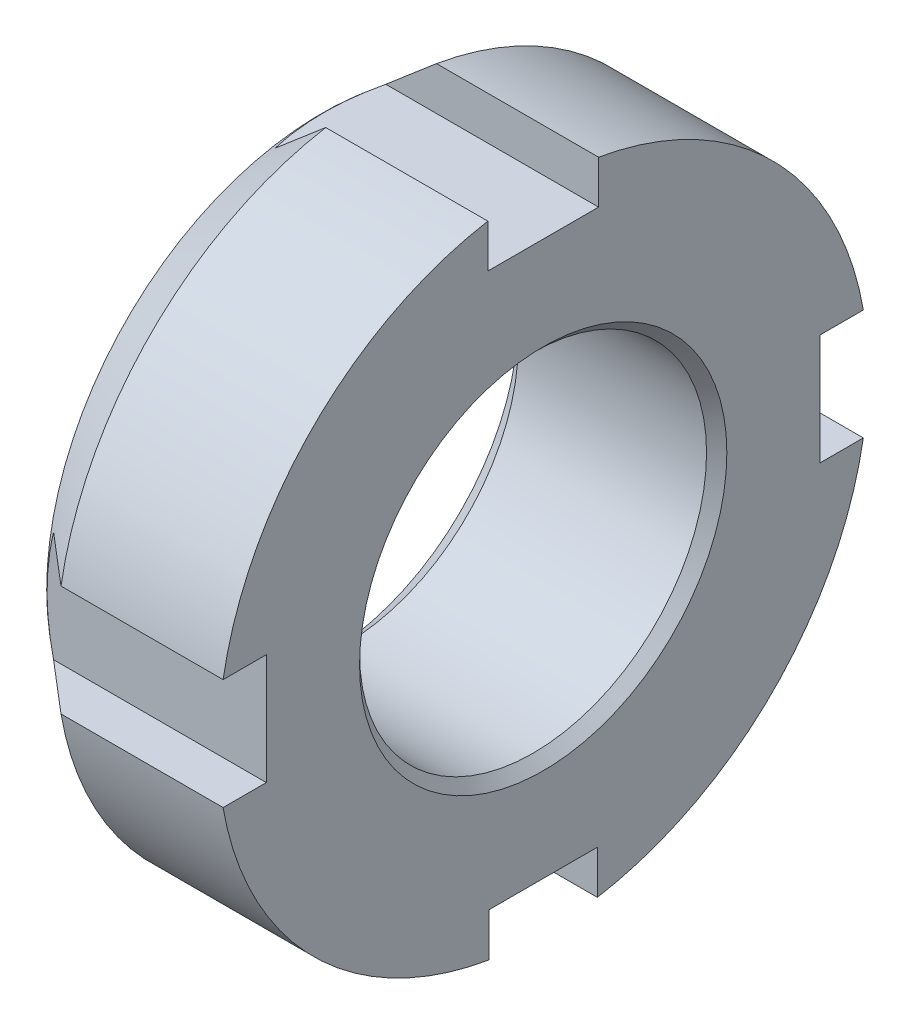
from build123d import *

# Parameters (mm, degrees)
SKETCH1_R          = 2.54
PLACE_HOLDER_DEPTH = 0.254
CUT_EXTRUDE3_DEPTH = 18.546234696


with BuildPart() as part:
    # Sketch1 → Place Holder (new body)
    with BuildSketch(Plane(origin=(0, 0, 0), x_dir=(0, 0, -1), z_dir=(1, 0, 0))):
        Circle(SKETCH1_R)
    extrude(amount=PLACE_HOLDER_DEPTH)


with BuildPart() as body_2:
    # Sketch6 → Revolve3 (revolve)
    with BuildSketch(Plane.XY, mode=Mode.PRIVATE) as revolve3_sk:
        Polygon((0, 9.4615), (2.043261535, 11.176), (7.62, 11.176), (7.62, 6.31825), (7.27075, 5.969), (0.79375, 5.969), (0, 6.76275), align=None)
    revolve(revolve3_sk.sketch.rotate(Axis((0, 0, 0), (1, 0, 0)), 90), axis=Axis((0, 0, 0), (1, 0, 0)))

    # Sketch7 → Cut-Extrude3 (cut, through all)
    with BuildSketch(Plane(origin=(7.62, 0, 0), x_dir=(0, 0, -1), z_dir=(1, 0, 0))):
        with BuildLine():
            Line((-9.525, 1.905), (-9.525, -1.905))
            Line((-9.525, -1.905), (-11.012445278, -1.905))
            ThreePointArc((-11.012445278, -1.905), (-11.176, 0), (-11.012445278, 1.905))
            Line((-11.012445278, 1.905), (-9.525, 1.905))
        make_face()
        with BuildLine():
            Line((9.525, 1.905), (9.525, -1.905))
            Line((9.525, -1.905), (11.012445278, -1.905))
            ThreePointArc((11.012445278, -1.905), (11.176, 0), (11.012445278, 1.905))
            Line((11.012445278, 1.905), (9.525, 1.905))
        make_face()
        with BuildLine():
            Line((-1.905, 11.012445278), (-1.905, 9.525))
            Line((-1.905, 9.525), (1.905, 9.525))
            Line((1.905, 9.525), (1.905, 11.012445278))
            ThreePointArc((1.905, 11.012445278), (0, 11.176), (-1.905, 11.012445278))
        make_face()
        with BuildLine():
            Line((-1.862666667, -9.525), (1.862666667, -9.525))
            Line((1.862666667, -9.525), (1.862666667, -11.019684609))
            ThreePointArc((1.862666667, -11.019684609), (0, -11.176), (-1.862666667, -11.019684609))
            Line((-1.862666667, -11.019684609), (-1.862666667, -9.525))
        make_face()
    extrude(amount=-CUT_EXTRUDE3_DEPTH, mode=Mode.SUBTRACT)


solid = Compound([part.part, body_2.part])
